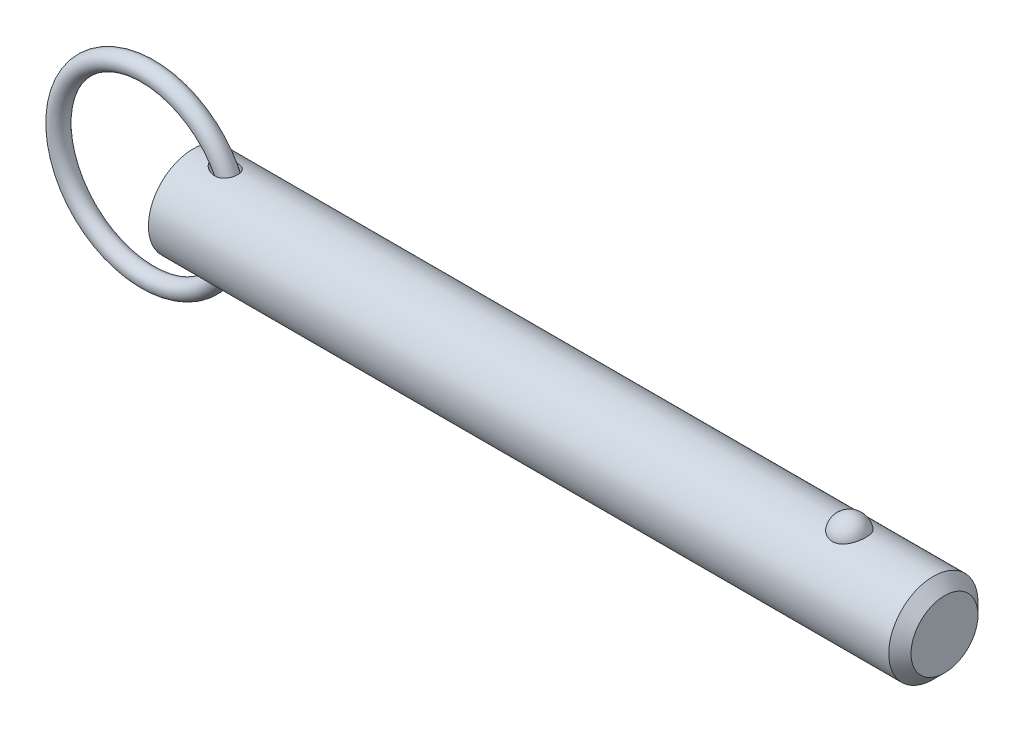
ISO-10303-21;
HEADER;
FILE_DESCRIPTION(('STEP AP214'),'2;1');
FILE_NAME('part.step','',(''),(''),'','','');
FILE_SCHEMA(('AUTOMOTIVE_DESIGN { 1 0 10303 214 1 1 1 1 }'));
ENDSEC;
DATA;
#1=APPLICATION_CONTEXT('core data for automotive mechanical design processes');
#2=APPLICATION_PROTOCOL_DEFINITION('international standard','automotive_design',2000,#1);
#3=PRODUCT_CONTEXT('',#1,'mechanical');
#4=PRODUCT('Part','Part','',(#3));
#5=PRODUCT_RELATED_PRODUCT_CATEGORY('part','',(#4));
#6=PRODUCT_DEFINITION_FORMATION('','',#4);
#7=PRODUCT_DEFINITION_CONTEXT('part definition',#1,'design');
#8=PRODUCT_DEFINITION('design','',#6,#7);
#9=PRODUCT_DEFINITION_SHAPE('','',#8);
#10=(LENGTH_UNIT() NAMED_UNIT(*) SI_UNIT(.MILLI.,.METRE.));
#11=(NAMED_UNIT(*) PLANE_ANGLE_UNIT() SI_UNIT($,.RADIAN.));
#12=(NAMED_UNIT(*) SI_UNIT($,.STERADIAN.) SOLID_ANGLE_UNIT());
#13=UNCERTAINTY_MEASURE_WITH_UNIT(LENGTH_MEASURE(1.E-05),#10,'distance_accuracy_value','');
#14=(GEOMETRIC_REPRESENTATION_CONTEXT(3) GLOBAL_UNCERTAINTY_ASSIGNED_CONTEXT((#13)) GLOBAL_UNIT_ASSIGNED_CONTEXT((#10,
#11,#12)) REPRESENTATION_CONTEXT('',''));
#15=CARTESIAN_POINT('',(0.,0.,0.));
#16=DIRECTION('',(0.,0.,1.));
#17=DIRECTION('',(1.,0.,0.));
#18=AXIS2_PLACEMENT_3D('',#15,#16,#17);
#19=CARTESIAN_POINT('',(-9.66825126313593,0.,0.));
#20=DIRECTION('',(0.,0.,1.));
#21=DIRECTION('',(1.,0.,0.));
#22=AXIS2_PLACEMENT_3D('',#19,#20,#21);
#23=TOROIDAL_SURFACE('',#22,19.05,1.905);
#24=CARTESIAN_POINT('',(11.2867487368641,0.,0.));
#25=VERTEX_POINT('',#24);
#26=VERTEX_LOOP('',#25);
#27=FACE_BOUND('',#26,.T.);
#28=ADVANCED_FACE('P0_F12',(#27),#23,.T.);
#29=CLOSED_SHELL('',(#28));
#30=MANIFOLD_SOLID_BREP('P0_B1',#29);
#31=CARTESIAN_POINT('',(0.,0.,0.));
#32=DIRECTION('',(1.,0.,0.));
#33=DIRECTION('',(0.,0.,-1.));
#34=AXIS2_PLACEMENT_3D('',#31,#32,#33);
#35=CYLINDRICAL_SURFACE('',#34,9.525);
#36=CARTESIAN_POINT('',(4.56693409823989,9.43141941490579,-1.33189820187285));
#37=CARTESIAN_POINT('',(4.70260475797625,9.41020313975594,-1.48215931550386));
#38=CARTESIAN_POINT('',(4.85555680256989,9.38755003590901,-1.61683982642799));
#39=CARTESIAN_POINT('',(5.10171959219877,9.35450554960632,-1.79512943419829));
#40=CARTESIAN_POINT('',(5.18674514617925,9.34362629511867,-1.85068909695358));
#41=CARTESIAN_POINT('',(5.3615438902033,9.32258514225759,-1.95392002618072));
#42=CARTESIAN_POINT('',(5.45131542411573,9.31242299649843,-2.00159402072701));
#43=CARTESIAN_POINT('',(5.70070211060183,9.28632120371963,-2.12033289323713));
#44=CARTESIAN_POINT('',(5.86420408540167,9.27146938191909,-2.18362944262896));
#45=CARTESIAN_POINT('',(6.19893345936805,9.24694163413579,-2.28525783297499));
#46=CARTESIAN_POINT('',(6.3701538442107,9.23726110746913,-2.32361187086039));
#47=CARTESIAN_POINT('',(6.73531776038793,9.22400982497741,-2.37575048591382));
#48=CARTESIAN_POINT('',(6.92975826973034,9.22118808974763,-2.38652934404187));
#49=CARTESIAN_POINT('',(7.21995443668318,9.22416297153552,-2.37494980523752));
#50=CARTESIAN_POINT('',(7.31643847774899,9.22635560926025,-2.366466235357));
#51=CARTESIAN_POINT('',(7.50796421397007,9.2331428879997,-2.33985028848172));
#52=CARTESIAN_POINT('',(7.6030065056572,9.23773650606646,-2.32172202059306));
#53=CARTESIAN_POINT('',(7.83273114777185,9.25183311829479,-2.26504721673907));
#54=CARTESIAN_POINT('',(7.96603028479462,9.26261470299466,-2.2209856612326));
#55=CARTESIAN_POINT('',(8.22310899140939,9.28816519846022,-2.1115730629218));
#56=CARTESIAN_POINT('',(8.34689477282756,9.30293147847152,-2.04623606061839));
#57=CARTESIAN_POINT('',(8.58136049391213,9.3349416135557,-1.89485344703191));
#58=CARTESIAN_POINT('',(8.69199721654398,9.35219324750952,-1.80874222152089));
#59=CARTESIAN_POINT('',(8.89592093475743,9.38707016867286,-1.61799188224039));
#60=CARTESIAN_POINT('',(8.98920771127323,9.40469546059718,-1.51335253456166));
#61=CARTESIAN_POINT('',(9.15057731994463,9.43713590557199,-1.29519427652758));
#62=CARTESIAN_POINT('',(9.21980158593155,9.45205440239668,-1.18253282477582));
#63=CARTESIAN_POINT('',(9.33826736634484,9.47856708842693,-0.946802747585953));
#64=CARTESIAN_POINT('',(9.38751161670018,9.49016173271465,-0.823735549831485));
#65=CARTESIAN_POINT('',(9.46423850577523,9.50859378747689,-0.57261402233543));
#66=CARTESIAN_POINT('',(9.49202393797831,9.5154972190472,-0.444656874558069));
#67=CARTESIAN_POINT('',(9.52636926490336,9.52406905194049,-0.185752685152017));
#68=CARTESIAN_POINT('',(9.53292923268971,9.52573747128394,-0.0548056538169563));
#69=CARTESIAN_POINT('',(9.52467276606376,9.52365852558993,0.20650329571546));
#70=CARTESIAN_POINT('',(9.50983454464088,9.51990564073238,0.336864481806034));
#71=CARTESIAN_POINT('',(9.45907362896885,9.50737852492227,0.593166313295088));
#72=CARTESIAN_POINT('',(9.42315106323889,9.49860432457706,0.719106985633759));
#73=CARTESIAN_POINT('',(9.3310664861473,9.4769892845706,0.96295935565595));
#74=CARTESIAN_POINT('',(9.27490839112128,9.46414923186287,1.08087260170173));
#75=CARTESIAN_POINT('',(9.14375803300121,9.43581000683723,1.30534632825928));
#76=CARTESIAN_POINT('',(9.06876720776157,9.42031103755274,1.41190767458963));
#77=CARTESIAN_POINT('',(8.90203187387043,9.38836719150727,1.61069439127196));
#78=CARTESIAN_POINT('',(8.81029913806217,9.37192298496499,1.70292975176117));
#79=CARTESIAN_POINT('',(8.6126877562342,9.33985045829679,1.87086859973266));
#80=CARTESIAN_POINT('',(8.50680947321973,9.3242221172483,1.94657251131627));
#81=CARTESIAN_POINT('',(8.28220546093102,9.29513431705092,2.08109032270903));
#82=CARTESIAN_POINT('',(8.16329919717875,9.28171415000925,2.13961034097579));
#83=CARTESIAN_POINT('',(7.91756052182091,9.25859072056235,2.23755716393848));
#84=CARTESIAN_POINT('',(7.79072606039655,9.24888842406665,2.27697900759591));
#85=CARTESIAN_POINT('',(7.52377913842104,9.23338749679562,2.33907806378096));
#86=CARTESIAN_POINT('',(7.3833476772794,9.22789571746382,2.36044900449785));
#87=CARTESIAN_POINT('',(7.1008139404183,9.22210229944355,2.3829751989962));
#88=CARTESIAN_POINT('',(6.95871103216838,9.22180269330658,2.38412253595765));
#89=CARTESIAN_POINT('',(6.65642691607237,9.22632724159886,2.36656230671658));
#90=CARTESIAN_POINT('',(6.49641694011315,9.23185415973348,2.3451317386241));
#91=CARTESIAN_POINT('',(6.18115433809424,9.24811737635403,2.28014143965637));
#92=CARTESIAN_POINT('',(6.02590710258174,9.25885936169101,2.23655754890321));
#93=CARTESIAN_POINT('',(5.69904720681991,9.28624254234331,2.12025087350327));
#94=CARTESIAN_POINT('',(5.52873601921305,9.30354853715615,2.04400672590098));
#95=CARTESIAN_POINT('',(5.20289495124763,9.34106989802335,1.86504730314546));
#96=CARTESIAN_POINT('',(5.0473596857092,9.36128419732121,1.76234172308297));
#97=CARTESIAN_POINT('',(4.79287124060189,9.39697639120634,1.55895334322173));
#98=CARTESIAN_POINT('',(4.6893870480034,9.41240250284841,1.46392900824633));
#99=CARTESIAN_POINT('',(4.4984714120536,9.44202586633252,1.25875918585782));
#100=CARTESIAN_POINT('',(4.41101129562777,9.45622528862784,1.1486413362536));
#101=CARTESIAN_POINT('',(4.27502257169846,9.47888210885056,0.940600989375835));
#102=CARTESIAN_POINT('',(4.22216329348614,9.48791121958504,0.845586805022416));
#103=CARTESIAN_POINT('',(4.13241478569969,9.50344321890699,0.648051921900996));
#104=CARTESIAN_POINT('',(4.0955118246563,9.50994827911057,0.545537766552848));
#105=CARTESIAN_POINT('',(4.04043124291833,9.51971586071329,0.334452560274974));
#106=CARTESIAN_POINT('',(4.02240728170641,9.52295176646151,0.225839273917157));
#107=CARTESIAN_POINT('',(4.00750873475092,9.52562364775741,0.00713006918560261));
#108=CARTESIAN_POINT('',(4.01062334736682,9.52506156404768,-0.102965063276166));
#109=CARTESIAN_POINT('',(4.03592967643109,9.52053221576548,-0.306944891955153));
#110=CARTESIAN_POINT('',(4.05571676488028,9.51699426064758,-0.401151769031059));
#111=CARTESIAN_POINT('',(4.10967975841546,9.5074546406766,-0.585176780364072));
#112=CARTESIAN_POINT('',(4.1438599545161,9.50145224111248,-0.674993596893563));
#113=CARTESIAN_POINT('',(4.23261356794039,9.48611703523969,-0.866116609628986));
#114=CARTESIAN_POINT('',(4.28990016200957,9.47635800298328,-0.966121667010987));
#115=CARTESIAN_POINT('',(4.4185657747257,9.45502867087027,-1.15640011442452));
#116=CARTESIAN_POINT('',(4.4899691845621,9.44345524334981,-1.24665623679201));
#117=CARTESIAN_POINT('',(4.56693409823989,9.43141941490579,-1.33189820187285));
#118=B_SPLINE_CURVE_WITH_KNOTS('',3,(#36,#37,#38,#39,#40,#41,#42,#43,#44,#45,#46,#47,#48,#49,
#50,#51,#52,#53,#54,#55,#56,#57,#58,#59,#60,#61,#62,#63,#64,#65,#66,#67,#68,#69,#70,#71,#72,#73,
#74,#75,#76,#77,#78,#79,#80,#81,#82,#83,#84,#85,#86,#87,#88,#89,#90,#91,#92,#93,#94,#95,#96,#97,
#98,#99,#100,#101,#102,#103,#104,#105,#106,#107,#108,#109,#110,#111,#112,#113,#114,#115,#116,
#117),.UNSPECIFIED.,.T.,.F.,(4,2,2,2,2,2,2,2,2,2,2,2,2,2,2,2,2,2,2,2,2,2,2,2,2,2,2,2,2,2,2,2,2,
2,2,2,2,2,2,2,4),(0.,0.609951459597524,0.916123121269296,1.22218863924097,1.74791337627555,
2.27316961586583,2.85362722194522,3.14383229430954,3.43391382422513,3.85437497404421,
4.27455920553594,4.69608835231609,5.11762282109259,5.5149005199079,5.91212379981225,
6.30363414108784,6.69514313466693,7.08705103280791,7.47895654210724,7.87078624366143,
8.26258603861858,8.65411137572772,9.04562666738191,9.44349251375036,9.84146165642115,
10.2662286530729,10.6911619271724,11.1739180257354,11.6572017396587,12.2170157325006,
12.7766249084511,13.1992556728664,13.6211226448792,13.9471990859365,14.2729943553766,
14.6014211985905,14.9296802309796,15.2173810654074,15.505167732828,15.8505863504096,
16.1966070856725),.UNSPECIFIED.);
#119=CARTESIAN_POINT('',(4.56693409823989,9.43141941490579,-1.33189820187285));
#120=VERTEX_POINT('',#119);
#121=EDGE_CURVE('P1_E40',#120,#120,#118,.T.);
#122=ORIENTED_EDGE('',*,*,#121,.T.);
#123=EDGE_LOOP('',(#122));
#124=FACE_BOUND('',#123,.T.);
#125=CARTESIAN_POINT('',(157.94875,0.,0.));
#126=DIRECTION('',(1.,0.,0.));
#127=DIRECTION('',(0.,0.,-1.));
#128=AXIS2_PLACEMENT_3D('',#125,#126,#127);
#129=CIRCLE('',#128,9.525);
#130=CARTESIAN_POINT('',(157.94875,0.,-9.525));
#131=VERTEX_POINT('',#130);
#132=EDGE_CURVE('P1_E25',#131,#131,#129,.T.);
#133=ORIENTED_EDGE('',*,*,#132,.F.);
#134=EDGE_LOOP('',(#133));
#135=FACE_BOUND('',#134,.T.);
#136=CARTESIAN_POINT('',(0.,0.,0.));
#137=DIRECTION('',(1.,0.,0.));
#138=DIRECTION('',(0.,0.,-1.));
#139=AXIS2_PLACEMENT_3D('',#136,#137,#138);
#140=CIRCLE('',#139,9.525);
#141=CARTESIAN_POINT('',(0.,0.,-9.525));
#142=VERTEX_POINT('',#141);
#143=EDGE_CURVE('P1_E9',#142,#142,#140,.T.);
#144=ORIENTED_EDGE('',*,*,#143,.T.);
#145=EDGE_LOOP('',(#144));
#146=FACE_BOUND('',#145,.T.);
#147=CARTESIAN_POINT('',(140.045757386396,8.80405803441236,3.63513233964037));
#148=CARTESIAN_POINT('',(139.951676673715,8.80405953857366,3.63513053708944));
#149=CARTESIAN_POINT('',(139.857561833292,8.80561325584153,3.63137461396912));
#150=CARTESIAN_POINT('',(139.670012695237,8.81177748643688,3.616386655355));
#151=CARTESIAN_POINT('',(139.576578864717,8.81638992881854,3.60514990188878));
#152=CARTESIAN_POINT('',(139.297945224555,8.83467114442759,3.56024627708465));
#153=CARTESIAN_POINT('',(139.114691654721,8.85278327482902,3.51538626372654));
#154=CARTESIAN_POINT('',(138.759509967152,8.89871214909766,3.39742145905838));
#155=CARTESIAN_POINT('',(138.587553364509,8.9265032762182,3.32439116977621));
#156=CARTESIAN_POINT('',(138.258707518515,8.98874819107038,3.15220244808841));
#157=CARTESIAN_POINT('',(138.101811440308,9.02319893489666,3.053055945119));
#158=CARTESIAN_POINT('',(137.802214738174,9.0962918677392,2.82797815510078));
#159=CARTESIAN_POINT('',(137.660060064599,9.13502685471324,2.70135138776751));
#160=CARTESIAN_POINT('',(137.398299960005,9.21186572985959,2.42641932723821));
#161=CARTESIAN_POINT('',(137.278701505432,9.2499694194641,2.27810735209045));
#162=CARTESIAN_POINT('',(137.059645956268,9.3234108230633,1.95652290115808));
#163=CARTESIAN_POINT('',(136.961317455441,9.35855090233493,1.78243511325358));
#164=CARTESIAN_POINT('',(136.793819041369,9.42045142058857,1.41937246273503));
#165=CARTESIAN_POINT('',(136.724651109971,9.44721128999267,1.23039658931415));
#166=CARTESIAN_POINT('',(136.616199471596,9.48990641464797,0.840370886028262));
#167=CARTESIAN_POINT('',(136.577288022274,9.50570658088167,0.639202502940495));
#168=CARTESIAN_POINT('',(136.531555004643,9.52433146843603,0.232664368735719));
#169=CARTESIAN_POINT('',(136.524732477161,9.52715657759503,0.0272947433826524));
#170=CARTESIAN_POINT('',(136.543255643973,9.51956918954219,-0.380478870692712));
#171=CARTESIAN_POINT('',(136.568405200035,9.50923740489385,-0.582893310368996));
#172=CARTESIAN_POINT('',(136.65002537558,9.47651897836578,-0.980293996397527));
#173=CARTESIAN_POINT('',(136.706496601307,9.45413210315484,-1.17528009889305));
#174=CARTESIAN_POINT('',(136.849719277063,9.39954044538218,-1.55263697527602));
#175=CARTESIAN_POINT('',(136.936512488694,9.36732213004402,-1.73498993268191));
#176=CARTESIAN_POINT('',(137.138610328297,9.29640700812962,-2.08177763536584));
#177=CARTESIAN_POINT('',(137.253917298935,9.25770966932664,-2.24621090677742));
#178=CARTESIAN_POINT('',(137.511264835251,9.17775604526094,-2.5533833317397));
#179=CARTESIAN_POINT('',(137.653434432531,9.136488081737,-2.69601150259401));
#180=CARTESIAN_POINT('',(137.96089985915,9.05620497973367,-2.95451229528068));
#181=CARTESIAN_POINT('',(138.126193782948,9.01718965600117,-3.07038711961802));
#182=CARTESIAN_POINT('',(138.472052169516,8.9468001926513,-3.26976836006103));
#183=CARTESIAN_POINT('',(138.652227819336,8.91528408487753,-3.35389750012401));
#184=CARTESIAN_POINT('',(139.025651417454,8.86272514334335,-3.49043503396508));
#185=CARTESIAN_POINT('',(139.218894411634,8.8416783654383,-3.54285537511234));
#186=CARTESIAN_POINT('',(139.602503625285,8.81348056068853,-3.61241306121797));
#187=CARTESIAN_POINT('',(139.792525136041,8.80568348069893,-3.63119339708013));
#188=CARTESIAN_POINT('',(140.173190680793,8.80289410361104,-3.6379534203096));
#189=CARTESIAN_POINT('',(140.363834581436,8.8078992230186,-3.6259393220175));
#190=CARTESIAN_POINT('',(140.734007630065,8.82974915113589,-3.57238430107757));
#191=CARTESIAN_POINT('',(140.913697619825,8.84621463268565,-3.53178890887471));
#192=CARTESIAN_POINT('',(141.263422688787,8.88875330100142,-3.42331083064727));
#193=CARTESIAN_POINT('',(141.433456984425,8.91482726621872,-3.35542593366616));
#194=CARTESIAN_POINT('',(141.763237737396,8.97448239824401,-3.19248225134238));
#195=CARTESIAN_POINT('',(141.922680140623,9.00821446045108,-3.09686474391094));
#196=CARTESIAN_POINT('',(142.223513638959,9.0793539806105,-2.88162736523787));
#197=CARTESIAN_POINT('',(142.364900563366,9.1167622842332,-2.7620019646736));
#198=CARTESIAN_POINT('',(142.63331931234,9.19347419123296,-2.49516285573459));
#199=CARTESIAN_POINT('',(142.759275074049,9.23277872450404,-2.34686614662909));
#200=CARTESIAN_POINT('',(142.985522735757,9.30737610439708,-2.03093683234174));
#201=CARTESIAN_POINT('',(143.08581004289,9.34266823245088,-1.86330077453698));
#202=CARTESIAN_POINT('',(143.261514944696,9.40674710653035,-1.50744893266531));
#203=CARTESIAN_POINT('',(143.336041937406,9.4352917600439,-1.31874876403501));
#204=CARTESIAN_POINT('',(143.45416505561,9.4814413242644,-0.930631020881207));
#205=CARTESIAN_POINT('',(143.497760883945,9.49904612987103,-0.731213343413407));
#206=CARTESIAN_POINT('',(143.553158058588,9.5215314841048,-0.327147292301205));
#207=CARTESIAN_POINT('',(143.564935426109,9.52640243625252,-0.122495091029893));
#208=CARTESIAN_POINT('',(143.556382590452,9.52289571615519,0.286018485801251));
#209=CARTESIAN_POINT('',(143.53605305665,9.51451832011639,0.48987987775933));
#210=CARTESIAN_POINT('',(143.463884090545,9.48544083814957,0.889994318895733));
#211=CARTESIAN_POINT('',(143.412199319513,9.46480124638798,1.08627971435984));
#212=CARTESIAN_POINT('',(143.278491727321,9.4133389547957,1.46682086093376));
#213=CARTESIAN_POINT('',(143.196466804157,9.38251554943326,1.65107577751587));
#214=CARTESIAN_POINT('',(143.00319292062,9.31365636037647,2.00346348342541));
#215=CARTESIAN_POINT('',(142.891783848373,9.27558138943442,2.17150083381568));
#216=CARTESIAN_POINT('',(142.642294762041,9.19638714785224,2.48563115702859));
#217=CARTESIAN_POINT('',(142.504216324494,9.15526805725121,2.63172542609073));
#218=CARTESIAN_POINT('',(142.204843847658,9.07465393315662,2.89750997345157));
#219=CARTESIAN_POINT('',(142.043610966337,9.03515496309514,3.01726776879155));
#220=CARTESIAN_POINT('',(141.701613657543,8.96227564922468,3.22732920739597));
#221=CARTESIAN_POINT('',(141.520841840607,8.92889763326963,3.31762165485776));
#222=CARTESIAN_POINT('',(141.151445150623,8.87345380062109,3.46314419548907));
#223=CARTESIAN_POINT('',(140.96332371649,8.85102983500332,3.51950082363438));
#224=CARTESIAN_POINT('',(140.67578699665,8.82666967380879,3.57993683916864));
#225=CARTESIAN_POINT('',(140.579133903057,8.82009725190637,3.59606217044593));
#226=CARTESIAN_POINT('',(140.384677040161,8.81020897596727,3.62022512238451));
#227=CARTESIAN_POINT('',(140.28687410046,8.80689090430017,3.62826825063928));
#228=CARTESIAN_POINT('',(140.141224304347,8.80445615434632,3.63416760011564));
#229=CARTESIAN_POINT('',(140.093495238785,8.80405727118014,3.63513325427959));
#230=CARTESIAN_POINT('',(140.045757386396,8.80405803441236,3.63513233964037));
#231=B_SPLINE_CURVE_WITH_KNOTS('',3,(#147,#148,#149,#150,#151,#152,#153,#154,#155,#156,#157,
#158,#159,#160,#161,#162,#163,#164,#165,#166,#167,#168,#169,#170,#171,#172,#173,#174,#175,#176,
#177,#178,#179,#180,#181,#182,#183,#184,#185,#186,#187,#188,#189,#190,#191,#192,#193,#194,#195,
#196,#197,#198,#199,#200,#201,#202,#203,#204,#205,#206,#207,#208,#209,#210,#211,#212,#213,#214,
#215,#216,#217,#218,#219,#220,#221,#222,#223,#224,#225,#226,#227,#228,#229,#230),.UNSPECIFIED.,
.T.,.F.,(4,2,2,2,2,2,2,2,2,2,2,2,2,2,2,2,2,2,2,2,2,2,2,2,2,2,2,2,2,2,2,2,2,2,2,2,2,2,2,2,2,4),
(0.,0.282202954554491,0.564584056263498,1.13017050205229,1.69427128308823,2.25811483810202,
2.83836627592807,3.41879688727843,4.02497117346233,4.63118665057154,5.24474754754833,
5.85829010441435,6.46808687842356,7.07789545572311,7.68854723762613,8.29924920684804,
8.91296283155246,9.52662591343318,10.1275338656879,10.7282152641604,11.2986646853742,
11.868998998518,12.4213015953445,12.9736489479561,13.5380053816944,14.1024919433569,
14.6952986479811,15.2882113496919,15.8999469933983,16.5116885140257,17.1238909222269,
17.7360805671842,18.3452748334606,18.9545113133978,19.5671386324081,20.1797297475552,
20.7907316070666,21.4019653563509,21.9915938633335,22.2859053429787,22.580016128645,
22.7232098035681),.UNSPECIFIED.);
#232=CARTESIAN_POINT('',(140.045757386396,8.80405803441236,3.63513233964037));
#233=VERTEX_POINT('',#232);
#234=EDGE_CURVE('P1_E34',#233,#233,#231,.T.);
#235=ORIENTED_EDGE('',*,*,#234,.T.);
#236=EDGE_LOOP('',(#235));
#237=FACE_BOUND('',#236,.T.);
#238=CARTESIAN_POINT('',(4.56693409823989,-9.43141941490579,-1.33189820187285));
#239=CARTESIAN_POINT('',(4.48932984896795,-9.4435553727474,-1.24594548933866));
#240=CARTESIAN_POINT('',(4.41737309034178,-9.45522193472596,-1.1548795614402));
#241=CARTESIAN_POINT('',(4.28781047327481,-9.47670896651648,-0.962782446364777));
#242=CARTESIAN_POINT('',(4.23019403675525,-9.48653079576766,-0.861758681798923));
#243=CARTESIAN_POINT('',(4.132545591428,-9.5034118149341,-0.649723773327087));
#244=CARTESIAN_POINT('',(4.09271158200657,-9.51043980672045,-0.538615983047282));
#245=CARTESIAN_POINT('',(4.04973167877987,-9.51806966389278,-0.367764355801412));
#246=CARTESIAN_POINT('',(4.03820037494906,-9.52012756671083,-0.310118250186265));
#247=CARTESIAN_POINT('',(4.02100287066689,-9.52320274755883,-0.193935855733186));
#248=CARTESIAN_POINT('',(4.01533565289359,-9.52422020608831,-0.135399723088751));
#249=CARTESIAN_POINT('',(4.0081707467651,-9.52550497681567,0.0247266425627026));
#250=CARTESIAN_POINT('',(4.0127049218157,-9.52468821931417,0.126661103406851));
#251=CARTESIAN_POINT('',(4.03954973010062,-9.51988506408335,0.328012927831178));
#252=CARTESIAN_POINT('',(4.06186450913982,-9.51589792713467,0.42742969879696));
#253=CARTESIAN_POINT('',(4.12088980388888,-9.5054852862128,0.616362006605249));
#254=CARTESIAN_POINT('',(4.15684838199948,-9.49918763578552,0.706123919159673));
#255=CARTESIAN_POINT('',(4.24094647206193,-9.48470618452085,0.879522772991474));
#256=CARTESIAN_POINT('',(4.28909090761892,-9.47652162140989,0.96315722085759));
#257=CARTESIAN_POINT('',(4.42295891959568,-9.45426317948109,1.16513741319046));
#258=CARTESIAN_POINT('',(4.51523752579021,-9.43933320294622,1.27905352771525));
#259=CARTESIAN_POINT('',(4.71682295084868,-9.40825940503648,1.49055892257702));
#260=CARTESIAN_POINT('',(4.82617286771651,-9.39211256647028,1.58810554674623));
#261=CARTESIAN_POINT('',(5.09064226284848,-9.35555264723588,1.79246125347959));
#262=CARTESIAN_POINT('',(5.2499041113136,-9.33524115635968,1.89393122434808));
#263=CARTESIAN_POINT('',(5.58309255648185,-9.29785396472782,2.06968659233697));
#264=CARTESIAN_POINT('',(5.75702897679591,-9.28078045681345,2.14395359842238));
#265=CARTESIAN_POINT('',(6.11646882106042,-9.25213303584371,2.26440412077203));
#266=CARTESIAN_POINT('',(6.30205582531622,-9.2406056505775,2.31035092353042));
#267=CARTESIAN_POINT('',(6.67856093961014,-9.22541807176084,2.37029728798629));
#268=CARTESIAN_POINT('',(6.8694704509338,-9.2217458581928,2.3843456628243));
#269=CARTESIAN_POINT('',(7.21217144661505,-9.22344239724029,2.37775005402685));
#270=CARTESIAN_POINT('',(7.36409439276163,-9.22713860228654,2.36352577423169));
#271=CARTESIAN_POINT('',(7.66346227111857,-9.24048072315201,2.31082299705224));
#272=CARTESIAN_POINT('',(7.81090958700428,-9.25012341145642,2.27235765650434));
#273=CARTESIAN_POINT('',(8.09730316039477,-9.2746609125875,2.17003648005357));
#274=CARTESIAN_POINT('',(8.2361965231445,-9.28958517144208,2.10603803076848));
#275=CARTESIAN_POINT('',(8.49918675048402,-9.32290326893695,1.95324442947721));
#276=CARTESIAN_POINT('',(8.62328895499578,-9.34129584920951,1.86445826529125));
#277=CARTESIAN_POINT('',(8.84006515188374,-9.37706953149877,1.67466761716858));
#278=CARTESIAN_POINT('',(8.93465172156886,-9.39436331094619,1.57582357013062));
#279=CARTESIAN_POINT('',(9.10490234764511,-9.42761680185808,1.362809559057));
#280=CARTESIAN_POINT('',(9.18057146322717,-9.44357686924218,1.24864370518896));
#281=CARTESIAN_POINT('',(9.30789178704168,-9.47159985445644,1.01379272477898));
#282=CARTESIAN_POINT('',(9.36045544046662,-9.48380365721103,0.893617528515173));
#283=CARTESIAN_POINT('',(9.44498362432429,-9.50388751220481,0.645890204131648));
#284=CARTESIAN_POINT('',(9.47694947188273,-9.51176784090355,0.518338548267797));
#285=CARTESIAN_POINT('',(9.51944262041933,-9.52232073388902,0.260103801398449));
#286=CARTESIAN_POINT('',(9.53006646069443,-9.52501674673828,0.129437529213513));
#287=CARTESIAN_POINT('',(9.52993291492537,-9.52498309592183,-0.131885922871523));
#288=CARTESIAN_POINT('',(9.51917525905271,-9.52225336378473,-0.26254310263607));
#289=CARTESIAN_POINT('',(9.47648788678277,-9.51165418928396,-0.520312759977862));
#290=CARTESIAN_POINT('',(9.44453086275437,-9.50377811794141,-0.647420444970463));
#291=CARTESIAN_POINT('',(9.36015568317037,-9.48373425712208,-0.89429087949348));
#292=CARTESIAN_POINT('',(9.30773827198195,-9.47156662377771,-1.01405389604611));
#293=CARTESIAN_POINT('',(9.1838089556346,-9.44428888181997,-1.24269386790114));
#294=CARTESIAN_POINT('',(9.11232064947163,-9.42918241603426,-1.3515840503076));
#295=CARTESIAN_POINT('',(8.9521268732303,-9.39767706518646,-1.55562459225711));
#296=CARTESIAN_POINT('',(8.86342281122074,-9.3812782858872,-1.65077607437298));
#297=CARTESIAN_POINT('',(8.6710444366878,-9.34891827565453,-1.82517515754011));
#298=CARTESIAN_POINT('',(8.56732858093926,-9.33295841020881,-1.90437711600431));
#299=CARTESIAN_POINT('',(8.34818438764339,-9.30317889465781,-2.0449122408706));
#300=CARTESIAN_POINT('',(8.23275529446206,-9.28935938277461,-2.10624425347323));
#301=CARTESIAN_POINT('',(7.98961240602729,-9.26475003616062,-2.2120340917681));
#302=CARTESIAN_POINT('',(7.86162088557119,-9.25407358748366,-2.25587700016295));
#303=CARTESIAN_POINT('',(7.60027499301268,-9.23720810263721,-2.32397032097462));
#304=CARTESIAN_POINT('',(7.46691858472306,-9.23102078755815,-2.34821321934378));
#305=CARTESIAN_POINT('',(7.18516230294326,-9.22302718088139,-2.37943079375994));
#306=CARTESIAN_POINT('',(7.03654454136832,-9.22169704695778,-2.38452997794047));
#307=CARTESIAN_POINT('',(6.74015049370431,-9.22442327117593,-2.37395141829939));
#308=CARTESIAN_POINT('',(6.59237455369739,-9.22848170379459,-2.35826567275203));
#309=CARTESIAN_POINT('',(6.27762777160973,-9.2422287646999,-2.30385559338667));
#310=CARTESIAN_POINT('',(6.11124715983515,-9.25269504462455,-2.26192683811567));
#311=CARTESIAN_POINT('',(5.78635920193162,-9.27830776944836,-2.15445569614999));
#312=CARTESIAN_POINT('',(5.62786567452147,-9.29346211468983,-2.08887341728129));
#313=CARTESIAN_POINT('',(5.39013065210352,-9.31931237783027,-1.96924953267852));
#314=CARTESIAN_POINT('',(5.30683088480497,-9.32901725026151,-1.92292485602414));
#315=CARTESIAN_POINT('',(5.1445580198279,-9.34899035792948,-1.82334419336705));
#316=CARTESIAN_POINT('',(5.06558607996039,-9.35925874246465,-1.77008636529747));
#317=CARTESIAN_POINT('',(4.83670950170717,-9.39034445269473,-1.60010986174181));
#318=CARTESIAN_POINT('',(4.69422471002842,-9.41151337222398,-1.47288240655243));
#319=CARTESIAN_POINT('',(4.56693409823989,-9.43141941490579,-1.33189820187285));
#320=B_SPLINE_CURVE_WITH_KNOTS('',3,(#238,#239,#240,#241,#242,#243,#244,#245,#246,#247,#248,
#249,#250,#251,#252,#253,#254,#255,#256,#257,#258,#259,#260,#261,#262,#263,#264,#265,#266,#267,
#268,#269,#270,#271,#272,#273,#274,#275,#276,#277,#278,#279,#280,#281,#282,#283,#284,#285,#286,
#287,#288,#289,#290,#291,#292,#293,#294,#295,#296,#297,#298,#299,#300,#301,#302,#303,#304,#305,
#306,#307,#308,#309,#310,#311,#312,#313,#314,#315,#316,#317,#318,#319),.UNSPECIFIED.,.T.,.F.,(4,
2,2,2,2,2,2,2,2,2,2,2,2,2,2,2,2,2,2,2,2,2,2,2,2,2,2,2,2,2,2,2,2,2,2,2,2,2,2,2,4),(0.,
0.348900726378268,0.697543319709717,1.0499765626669,1.22617690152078,1.40234666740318,
1.70666745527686,2.01105922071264,2.30066493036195,2.59038784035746,3.03001384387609,
3.4707682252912,4.03766594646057,4.60494622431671,5.17690598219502,5.74798989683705,
6.20400848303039,6.65977977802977,7.11813321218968,7.57632066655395,7.98791759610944,
8.39940433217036,8.7927345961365,9.18603970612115,9.577561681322,9.9690885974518,
10.3611208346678,10.7531388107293,11.1446739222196,11.536177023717,11.9287850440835,
12.3214184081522,12.7268448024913,13.1324265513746,13.5768390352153,14.0214226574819,
14.5351685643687,15.0497849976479,15.3368801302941,15.6240516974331,16.1963372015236),.UNSPECIFIED.);
#321=CARTESIAN_POINT('',(4.56693409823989,-9.43141941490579,-1.33189820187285));
#322=VERTEX_POINT('',#321);
#323=EDGE_CURVE('P1_E17',#322,#322,#320,.T.);
#324=ORIENTED_EDGE('',*,*,#323,.T.);
#325=EDGE_LOOP('',(#324));
#326=FACE_BOUND('',#325,.T.);
#327=ADVANCED_FACE('P1_F13',(#124,#135,#146,#237,#326),#35,.T.);
#328=CARTESIAN_POINT('',(0.,0.,0.));
#329=DIRECTION('',(-1.,0.,0.));
#330=DIRECTION('',(0.,0.,1.));
#331=AXIS2_PLACEMENT_3D('',#328,#329,#330);
#332=PLANE('',#331);
#333=ORIENTED_EDGE('',*,*,#143,.F.);
#334=EDGE_LOOP('',(#333));
#335=FACE_BOUND('',#334,.T.);
#336=ADVANCED_FACE('P1_F15',(#335),#332,.T.);
#337=CARTESIAN_POINT('',(160.33,0.,0.));
#338=DIRECTION('',(-1.,0.,0.));
#339=DIRECTION('',(0.,0.,1.));
#340=AXIS2_PLACEMENT_3D('',#337,#338,#339);
#341=CONICAL_SURFACE('',#340,7.14375000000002,0.785398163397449);
#342=ORIENTED_EDGE('',*,*,#132,.T.);
#343=EDGE_LOOP('',(#342));
#344=FACE_BOUND('',#343,.T.);
#345=CARTESIAN_POINT('',(160.33,0.,0.));
#346=DIRECTION('',(1.,0.,0.));
#347=DIRECTION('',(0.,0.,-1.));
#348=AXIS2_PLACEMENT_3D('',#345,#346,#347);
#349=CIRCLE('',#348,7.14375000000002);
#350=CARTESIAN_POINT('',(160.33,0.,-7.14375000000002));
#351=VERTEX_POINT('',#350);
#352=EDGE_CURVE('P1_E30',#351,#351,#349,.T.);
#353=ORIENTED_EDGE('',*,*,#352,.F.);
#354=EDGE_LOOP('',(#353));
#355=FACE_BOUND('',#354,.T.);
#356=ADVANCED_FACE('P1_F55',(#344,#355),#341,.T.);
#357=CARTESIAN_POINT('',(160.33,7.14375000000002,0.));
#358=DIRECTION('',(1.,0.,0.));
#359=DIRECTION('',(0.,0.,-1.));
#360=AXIS2_PLACEMENT_3D('',#357,#358,#359);
#361=PLANE('',#360);
#362=ORIENTED_EDGE('',*,*,#352,.T.);
#363=EDGE_LOOP('',(#362));
#364=FACE_BOUND('',#363,.T.);
#365=ADVANCED_FACE('P1_F51',(#364),#361,.T.);
#366=CARTESIAN_POINT('',(140.045757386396,8.57249999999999,0.));
#367=DIRECTION('',(-1.,0.,0.));
#368=DIRECTION('',(0.,1.,0.));
#369=AXIS2_PLACEMENT_3D('',#366,#367,#368);
#370=SPHERICAL_SURFACE('',#369,3.64250000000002);
#371=ORIENTED_EDGE('',*,*,#234,.F.);
#372=EDGE_LOOP('',(#371));
#373=FACE_BOUND('',#372,.T.);
#374=ADVANCED_FACE('P1_F46',(#373),#370,.T.);
#375=CARTESIAN_POINT('',(-9.66825126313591,0.,0.));
#376=DIRECTION('',(0.,0.,1.));
#377=DIRECTION('',(1.,0.,0.));
#378=AXIS2_PLACEMENT_3D('',#375,#376,#377);
#379=TOROIDAL_SURFACE('',#378,19.05,2.38125);
#380=ORIENTED_EDGE('',*,*,#323,.F.);
#381=EDGE_LOOP('',(#380));
#382=FACE_BOUND('',#381,.T.);
#383=ORIENTED_EDGE('',*,*,#121,.F.);
#384=EDGE_LOOP('',(#383));
#385=FACE_BOUND('',#384,.T.);
#386=ADVANCED_FACE('P1_F50',(#382,#385),#379,.F.);
#387=CLOSED_SHELL('',(#327,#336,#356,#365,#374,#386));
#388=MANIFOLD_SOLID_BREP('P1_B1',#387);
#389=ADVANCED_BREP_SHAPE_REPRESENTATION('',(#18,#30,#388),#14);
#390=SHAPE_DEFINITION_REPRESENTATION(#9,#389);
ENDSEC;
END-ISO-10303-21;
